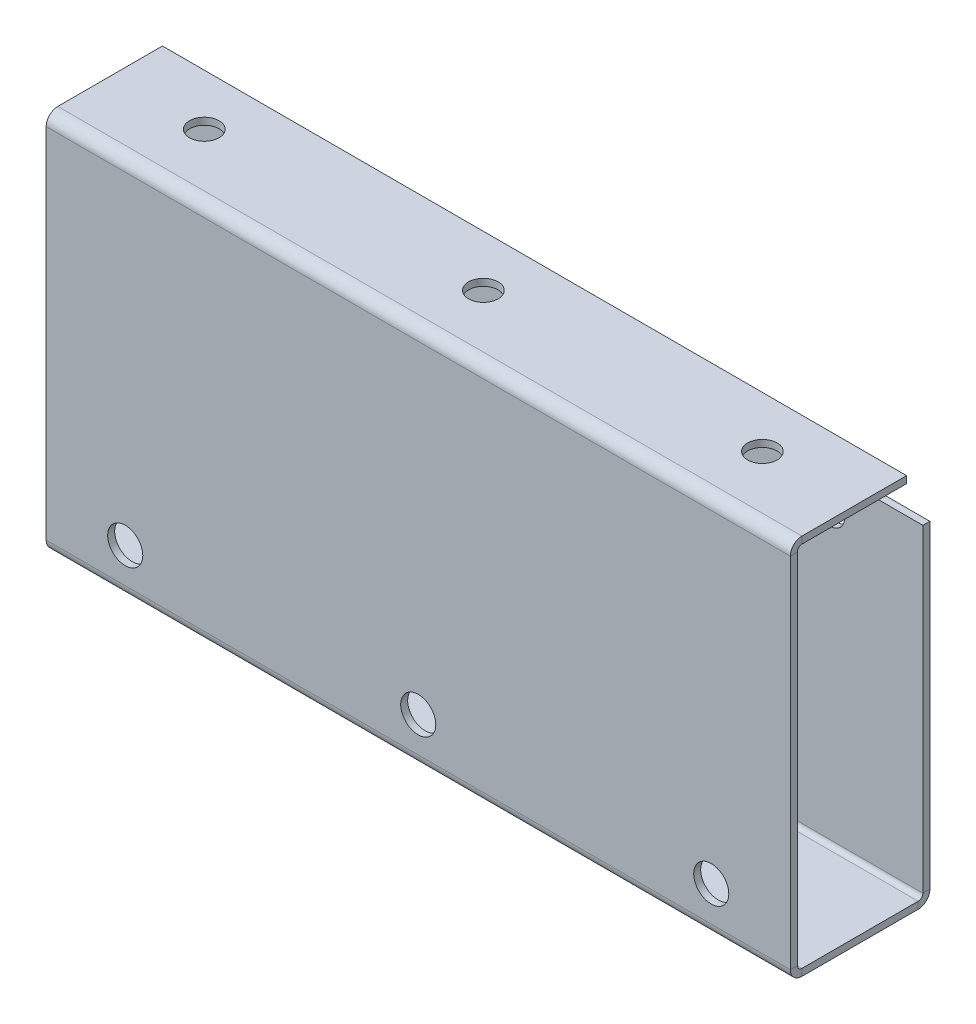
ISO-10303-21;
HEADER;
FILE_DESCRIPTION(('STEP AP214'),'2;1');
FILE_NAME('part.step','',(''),(''),'','','');
FILE_SCHEMA(('AUTOMOTIVE_DESIGN { 1 0 10303 214 1 1 1 1 }'));
ENDSEC;
DATA;
#1=APPLICATION_CONTEXT('core data for automotive mechanical design processes');
#2=APPLICATION_PROTOCOL_DEFINITION('international standard','automotive_design',2000,#1);
#3=PRODUCT_CONTEXT('',#1,'mechanical');
#4=PRODUCT('Part','Part','',(#3));
#5=PRODUCT_RELATED_PRODUCT_CATEGORY('part','',(#4));
#6=PRODUCT_DEFINITION_FORMATION('','',#4);
#7=PRODUCT_DEFINITION_CONTEXT('part definition',#1,'design');
#8=PRODUCT_DEFINITION('design','',#6,#7);
#9=PRODUCT_DEFINITION_SHAPE('','',#8);
#10=(LENGTH_UNIT() NAMED_UNIT(*) SI_UNIT(.MILLI.,.METRE.));
#11=(NAMED_UNIT(*) PLANE_ANGLE_UNIT() SI_UNIT($,.RADIAN.));
#12=(NAMED_UNIT(*) SI_UNIT($,.STERADIAN.) SOLID_ANGLE_UNIT());
#13=UNCERTAINTY_MEASURE_WITH_UNIT(LENGTH_MEASURE(1.E-05),#10,'distance_accuracy_value','');
#14=(GEOMETRIC_REPRESENTATION_CONTEXT(3) GLOBAL_UNCERTAINTY_ASSIGNED_CONTEXT((#13)) GLOBAL_UNIT_ASSIGNED_CONTEXT((#10,
#11,#12)) REPRESENTATION_CONTEXT('',''));
#15=CARTESIAN_POINT('',(0.,0.,0.));
#16=DIRECTION('',(0.,0.,1.));
#17=DIRECTION('',(1.,0.,0.));
#18=AXIS2_PLACEMENT_3D('',#15,#16,#17);
#19=CARTESIAN_POINT('',(80.,-82.,-27.5));
#20=DIRECTION('',(1.,0.,0.));
#21=DIRECTION('',(0.,0.,-1.));
#22=AXIS2_PLACEMENT_3D('',#19,#20,#21);
#23=PLANE('',#22);
#24=DIRECTION('',(0.,1.,0.));
#25=VECTOR('',#24,1.);
#26=CARTESIAN_POINT('',(80.,-82.,-27.5));
#27=LINE('',#26,#25);
#28=CARTESIAN_POINT('',(80.,-82.,-27.5));
#29=VERTEX_POINT('',#28);
#30=CARTESIAN_POINT('',(80.,-80.5,-27.5));
#31=VERTEX_POINT('',#30);
#32=EDGE_CURVE('E11',#29,#31,#27,.T.);
#33=ORIENTED_EDGE('',*,*,#32,.F.);
#34=CARTESIAN_POINT('',(80.,-79.5,-27.5));
#35=DIRECTION('',(1.,0.,0.));
#36=DIRECTION('',(0.,0.,-1.));
#37=AXIS2_PLACEMENT_3D('',#34,#35,#36);
#38=CIRCLE('',#37,2.5);
#39=CARTESIAN_POINT('',(80.,-79.5,-30.));
#40=VERTEX_POINT('',#39);
#41=EDGE_CURVE('E312',#40,#29,#38,.F.);
#42=ORIENTED_EDGE('',*,*,#41,.F.);
#43=DIRECTION('',(0.,0.,-1.));
#44=VECTOR('',#43,1.);
#45=CARTESIAN_POINT('',(80.,-79.5,-28.5));
#46=LINE('',#45,#44);
#47=CARTESIAN_POINT('',(80.,-79.5,-28.5));
#48=VERTEX_POINT('',#47);
#49=EDGE_CURVE('E45',#48,#40,#46,.T.);
#50=ORIENTED_EDGE('',*,*,#49,.F.);
#51=CARTESIAN_POINT('',(80.,-79.5,-27.5));
#52=DIRECTION('',(1.,0.,0.));
#53=DIRECTION('',(0.,0.,-1.));
#54=AXIS2_PLACEMENT_3D('',#51,#52,#53);
#55=CIRCLE('',#54,1.);
#56=EDGE_CURVE('E325',#48,#31,#55,.F.);
#57=ORIENTED_EDGE('',*,*,#56,.T.);
#58=EDGE_LOOP('',(#33,#42,#50,#57));
#59=FACE_BOUND('',#58,.T.);
#60=ADVANCED_FACE('F36',(#59),#23,.T.);
#61=CARTESIAN_POINT('',(80.,-79.5,-28.5));
#62=DIRECTION('',(1.,0.,0.));
#63=DIRECTION('',(0.,0.,-1.));
#64=AXIS2_PLACEMENT_3D('',#61,#62,#63);
#65=PLANE('',#64);
#66=DIRECTION('',(0.,0.,1.));
#67=VECTOR('',#66,1.);
#68=CARTESIAN_POINT('',(80.,-82.,0.));
#69=LINE('',#68,#67);
#70=CARTESIAN_POINT('',(80.,-82.,-2.50000000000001));
#71=VERTEX_POINT('',#70);
#72=EDGE_CURVE('E316',#29,#71,#69,.T.);
#73=ORIENTED_EDGE('',*,*,#72,.F.);
#74=ORIENTED_EDGE('',*,*,#32,.T.);
#75=DIRECTION('',(0.,0.,-1.));
#76=VECTOR('',#75,1.);
#77=CARTESIAN_POINT('',(80.,-80.5,0.));
#78=LINE('',#77,#76);
#79=CARTESIAN_POINT('',(80.,-80.5,-2.50000000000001));
#80=VERTEX_POINT('',#79);
#81=EDGE_CURVE('E180',#31,#80,#78,.F.);
#82=ORIENTED_EDGE('',*,*,#81,.T.);
#83=DIRECTION('',(0.,-1.,0.));
#84=VECTOR('',#83,1.);
#85=CARTESIAN_POINT('',(80.,-80.5,-2.50000000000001));
#86=LINE('',#85,#84);
#87=EDGE_CURVE('E171',#80,#71,#86,.T.);
#88=ORIENTED_EDGE('',*,*,#87,.T.);
#89=EDGE_LOOP('',(#73,#74,#82,#88));
#90=FACE_BOUND('',#89,.T.);
#91=ADVANCED_FACE('F330',(#90),#65,.T.);
#92=CARTESIAN_POINT('',(-80.,-79.5,-30.));
#93=DIRECTION('',(-1.,0.,0.));
#94=DIRECTION('',(0.,0.,1.));
#95=AXIS2_PLACEMENT_3D('',#92,#93,#94);
#96=PLANE('',#95);
#97=DIRECTION('',(0.,0.,1.));
#98=VECTOR('',#97,1.);
#99=CARTESIAN_POINT('',(-80.,-79.5,-30.));
#100=LINE('',#99,#98);
#101=CARTESIAN_POINT('',(-80.,-79.5,-30.));
#102=VERTEX_POINT('',#101);
#103=CARTESIAN_POINT('',(-80.,-79.5,-28.5));
#104=VERTEX_POINT('',#103);
#105=EDGE_CURVE('E291',#102,#104,#100,.T.);
#106=ORIENTED_EDGE('',*,*,#105,.F.);
#107=CARTESIAN_POINT('',(-80.,-79.5,-27.5));
#108=DIRECTION('',(1.,0.,0.));
#109=DIRECTION('',(0.,0.,-1.));
#110=AXIS2_PLACEMENT_3D('',#107,#108,#109);
#111=CIRCLE('',#110,2.5);
#112=CARTESIAN_POINT('',(-80.,-82.,-27.5));
#113=VERTEX_POINT('',#112);
#114=EDGE_CURVE('E221',#102,#113,#111,.F.);
#115=ORIENTED_EDGE('',*,*,#114,.T.);
#116=DIRECTION('',(0.,-1.,0.));
#117=VECTOR('',#116,1.);
#118=CARTESIAN_POINT('',(-80.,-80.5,-27.5));
#119=LINE('',#118,#117);
#120=CARTESIAN_POINT('',(-80.,-80.5,-27.5));
#121=VERTEX_POINT('',#120);
#122=EDGE_CURVE('E170',#121,#113,#119,.T.);
#123=ORIENTED_EDGE('',*,*,#122,.F.);
#124=CARTESIAN_POINT('',(-80.,-79.5,-27.5));
#125=DIRECTION('',(1.,0.,0.));
#126=DIRECTION('',(0.,0.,-1.));
#127=AXIS2_PLACEMENT_3D('',#124,#125,#126);
#128=CIRCLE('',#127,1.);
#129=EDGE_CURVE('E233',#104,#121,#128,.F.);
#130=ORIENTED_EDGE('',*,*,#129,.F.);
#131=EDGE_LOOP('',(#106,#115,#123,#130));
#132=FACE_BOUND('',#131,.T.);
#133=ADVANCED_FACE('F383',(#132),#96,.T.);
#134=CARTESIAN_POINT('',(-80.,-80.5,-27.5));
#135=DIRECTION('',(-1.,0.,0.));
#136=DIRECTION('',(0.,0.,1.));
#137=AXIS2_PLACEMENT_3D('',#134,#135,#136);
#138=PLANE('',#137);
#139=DIRECTION('',(0.,-1.,0.));
#140=VECTOR('',#139,1.);
#141=CARTESIAN_POINT('',(-80.,-82.,-30.));
#142=LINE('',#141,#140);
#143=CARTESIAN_POINT('',(-80.,-11.,-30.));
#144=VERTEX_POINT('',#143);
#145=EDGE_CURVE('E224',#144,#102,#142,.T.);
#146=ORIENTED_EDGE('',*,*,#145,.T.);
#147=ORIENTED_EDGE('',*,*,#105,.T.);
#148=DIRECTION('',(0.,-1.,0.));
#149=VECTOR('',#148,1.);
#150=CARTESIAN_POINT('',(-80.,-82.,-28.5));
#151=LINE('',#150,#149);
#152=CARTESIAN_POINT('',(-80.,-11.,-28.5));
#153=VERTEX_POINT('',#152);
#154=EDGE_CURVE('E230',#153,#104,#151,.T.);
#155=ORIENTED_EDGE('',*,*,#154,.F.);
#156=DIRECTION('',(0.,0.,-1.));
#157=VECTOR('',#156,1.);
#158=CARTESIAN_POINT('',(-80.,-11.,-28.5));
#159=LINE('',#158,#157);
#160=EDGE_CURVE('E227',#153,#144,#159,.T.);
#161=ORIENTED_EDGE('',*,*,#160,.T.);
#162=EDGE_LOOP('',(#146,#147,#155,#161));
#163=FACE_BOUND('',#162,.T.);
#164=ADVANCED_FACE('F387',(#163),#138,.T.);
#165=CARTESIAN_POINT('',(80.,-79.5,0.));
#166=DIRECTION('',(1.,0.,0.));
#167=DIRECTION('',(0.,0.,-1.));
#168=AXIS2_PLACEMENT_3D('',#165,#166,#167);
#169=PLANE('',#168);
#170=DIRECTION('',(0.,0.,-1.));
#171=VECTOR('',#170,1.);
#172=CARTESIAN_POINT('',(80.,-79.5,0.));
#173=LINE('',#172,#171);
#174=CARTESIAN_POINT('',(80.,-79.5,0.));
#175=VERTEX_POINT('',#174);
#176=CARTESIAN_POINT('',(80.,-79.5,-1.50000000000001));
#177=VERTEX_POINT('',#176);
#178=EDGE_CURVE('E158',#175,#177,#173,.T.);
#179=ORIENTED_EDGE('',*,*,#178,.F.);
#180=CARTESIAN_POINT('',(80.,-79.5,-2.50000000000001));
#181=DIRECTION('',(1.,0.,0.));
#182=DIRECTION('',(0.,0.,-1.));
#183=AXIS2_PLACEMENT_3D('',#180,#181,#182);
#184=CIRCLE('',#183,2.5);
#185=EDGE_CURVE('E342',#71,#175,#184,.F.);
#186=ORIENTED_EDGE('',*,*,#185,.F.);
#187=ORIENTED_EDGE('',*,*,#87,.F.);
#188=CARTESIAN_POINT('',(80.,-79.5,-2.50000000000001));
#189=DIRECTION('',(1.,0.,0.));
#190=DIRECTION('',(0.,0.,-1.));
#191=AXIS2_PLACEMENT_3D('',#188,#189,#190);
#192=CIRCLE('',#191,1.);
#193=EDGE_CURVE('E174',#80,#177,#192,.F.);
#194=ORIENTED_EDGE('',*,*,#193,.T.);
#195=EDGE_LOOP('',(#179,#186,#187,#194));
#196=FACE_BOUND('',#195,.T.);
#197=ADVANCED_FACE('F176',(#196),#169,.T.);
#198=CARTESIAN_POINT('',(80.,-80.5,-2.50000000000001));
#199=DIRECTION('',(1.,0.,0.));
#200=DIRECTION('',(0.,0.,-1.));
#201=AXIS2_PLACEMENT_3D('',#198,#199,#200);
#202=PLANE('',#201);
#203=DIRECTION('',(0.,1.,0.));
#204=VECTOR('',#203,1.);
#205=CARTESIAN_POINT('',(80.,0.,0.));
#206=LINE('',#205,#204);
#207=CARTESIAN_POINT('',(80.,-2.5,0.));
#208=VERTEX_POINT('',#207);
#209=EDGE_CURVE('E165',#175,#208,#206,.T.);
#210=ORIENTED_EDGE('',*,*,#209,.F.);
#211=ORIENTED_EDGE('',*,*,#178,.T.);
#212=DIRECTION('',(0.,1.,0.));
#213=VECTOR('',#212,1.);
#214=CARTESIAN_POINT('',(80.,0.,-1.5));
#215=LINE('',#214,#213);
#216=CARTESIAN_POINT('',(80.,-2.5,-1.5));
#217=VERTEX_POINT('',#216);
#218=EDGE_CURVE('E162',#177,#217,#215,.T.);
#219=ORIENTED_EDGE('',*,*,#218,.T.);
#220=DIRECTION('',(0.,0.,1.));
#221=VECTOR('',#220,1.);
#222=CARTESIAN_POINT('',(80.,-2.5,-1.5));
#223=LINE('',#222,#221);
#224=EDGE_CURVE('E282',#217,#208,#223,.T.);
#225=ORIENTED_EDGE('',*,*,#224,.T.);
#226=EDGE_LOOP('',(#210,#211,#219,#225));
#227=FACE_BOUND('',#226,.T.);
#228=ADVANCED_FACE('F160',(#227),#202,.T.);
#229=CARTESIAN_POINT('',(-80.,-82.,-2.50000000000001));
#230=DIRECTION('',(-1.,0.,0.));
#231=DIRECTION('',(0.,0.,1.));
#232=AXIS2_PLACEMENT_3D('',#229,#230,#231);
#233=PLANE('',#232);
#234=DIRECTION('',(0.,1.,0.));
#235=VECTOR('',#234,1.);
#236=CARTESIAN_POINT('',(-80.,-82.,-2.50000000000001));
#237=LINE('',#236,#235);
#238=CARTESIAN_POINT('',(-80.,-82.,-2.50000000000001));
#239=VERTEX_POINT('',#238);
#240=CARTESIAN_POINT('',(-80.,-80.5,-2.50000000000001));
#241=VERTEX_POINT('',#240);
#242=EDGE_CURVE('E287',#239,#241,#237,.T.);
#243=ORIENTED_EDGE('',*,*,#242,.F.);
#244=CARTESIAN_POINT('',(-80.,-79.5,-2.50000000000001));
#245=DIRECTION('',(1.,0.,0.));
#246=DIRECTION('',(0.,0.,-1.));
#247=AXIS2_PLACEMENT_3D('',#244,#245,#246);
#248=CIRCLE('',#247,2.5);
#249=CARTESIAN_POINT('',(-80.,-79.5,0.));
#250=VERTEX_POINT('',#249);
#251=EDGE_CURVE('E215',#239,#250,#248,.F.);
#252=ORIENTED_EDGE('',*,*,#251,.T.);
#253=DIRECTION('',(0.,0.,1.));
#254=VECTOR('',#253,1.);
#255=CARTESIAN_POINT('',(-80.,-79.5,-1.50000000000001));
#256=LINE('',#255,#254);
#257=CARTESIAN_POINT('',(-80.,-79.5,-1.50000000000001));
#258=VERTEX_POINT('',#257);
#259=EDGE_CURVE('E285',#258,#250,#256,.T.);
#260=ORIENTED_EDGE('',*,*,#259,.F.);
#261=CARTESIAN_POINT('',(-80.,-79.5,-2.50000000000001));
#262=DIRECTION('',(1.,0.,0.));
#263=DIRECTION('',(0.,0.,-1.));
#264=AXIS2_PLACEMENT_3D('',#261,#262,#263);
#265=CIRCLE('',#264,1.);
#266=EDGE_CURVE('E187',#241,#258,#265,.F.);
#267=ORIENTED_EDGE('',*,*,#266,.F.);
#268=EDGE_LOOP('',(#243,#252,#260,#267));
#269=FACE_BOUND('',#268,.T.);
#270=ADVANCED_FACE('F336',(#269),#233,.T.);
#271=CARTESIAN_POINT('',(-80.,-79.5,-1.50000000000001));
#272=DIRECTION('',(-1.,0.,0.));
#273=DIRECTION('',(0.,0.,1.));
#274=AXIS2_PLACEMENT_3D('',#271,#272,#273);
#275=PLANE('',#274);
#276=DIRECTION('',(0.,0.,1.));
#277=VECTOR('',#276,1.);
#278=CARTESIAN_POINT('',(-80.,-82.,0.));
#279=LINE('',#278,#277);
#280=EDGE_CURVE('E218',#113,#239,#279,.T.);
#281=ORIENTED_EDGE('',*,*,#280,.T.);
#282=ORIENTED_EDGE('',*,*,#242,.T.);
#283=DIRECTION('',(0.,0.,-1.));
#284=VECTOR('',#283,1.);
#285=CARTESIAN_POINT('',(-80.,-80.5,0.));
#286=LINE('',#285,#284);
#287=EDGE_CURVE('E236',#121,#241,#286,.F.);
#288=ORIENTED_EDGE('',*,*,#287,.F.);
#289=ORIENTED_EDGE('',*,*,#122,.T.);
#290=EDGE_LOOP('',(#281,#282,#288,#289));
#291=FACE_BOUND('',#290,.T.);
#292=ADVANCED_FACE('F395',(#291),#275,.T.);
#293=CARTESIAN_POINT('',(80.,0.,-2.5));
#294=DIRECTION('',(1.,0.,0.));
#295=DIRECTION('',(0.,0.,-1.));
#296=AXIS2_PLACEMENT_3D('',#293,#294,#295);
#297=PLANE('',#296);
#298=DIRECTION('',(0.,-1.,0.));
#299=VECTOR('',#298,1.);
#300=CARTESIAN_POINT('',(80.,0.,-2.5));
#301=LINE('',#300,#299);
#302=CARTESIAN_POINT('',(80.,0.,-2.5));
#303=VERTEX_POINT('',#302);
#304=CARTESIAN_POINT('',(80.,-1.5,-2.5));
#305=VERTEX_POINT('',#304);
#306=EDGE_CURVE('E53',#303,#305,#301,.T.);
#307=ORIENTED_EDGE('',*,*,#306,.F.);
#308=CARTESIAN_POINT('',(80.,-2.5,-2.5));
#309=DIRECTION('',(1.,0.,0.));
#310=DIRECTION('',(0.,0.,-1.));
#311=AXIS2_PLACEMENT_3D('',#308,#309,#310);
#312=CIRCLE('',#311,2.5);
#313=EDGE_CURVE('E370',#208,#303,#312,.F.);
#314=ORIENTED_EDGE('',*,*,#313,.F.);
#315=ORIENTED_EDGE('',*,*,#224,.F.);
#316=CARTESIAN_POINT('',(80.,-2.5,-2.5));
#317=DIRECTION('',(1.,0.,0.));
#318=DIRECTION('',(0.,0.,-1.));
#319=AXIS2_PLACEMENT_3D('',#316,#317,#318);
#320=CIRCLE('',#319,1.);
#321=EDGE_CURVE('E195',#217,#305,#320,.F.);
#322=ORIENTED_EDGE('',*,*,#321,.T.);
#323=EDGE_LOOP('',(#307,#314,#315,#322));
#324=FACE_BOUND('',#323,.T.);
#325=ADVANCED_FACE('F397',(#324),#297,.T.);
#326=CARTESIAN_POINT('',(80.,-2.5,-1.5));
#327=DIRECTION('',(1.,0.,0.));
#328=DIRECTION('',(0.,0.,-1.));
#329=AXIS2_PLACEMENT_3D('',#326,#327,#328);
#330=PLANE('',#329);
#331=DIRECTION('',(0.,0.,-1.));
#332=VECTOR('',#331,1.);
#333=CARTESIAN_POINT('',(80.,0.,0.));
#334=LINE('',#333,#332);
#335=CARTESIAN_POINT('',(80.,0.,-25.));
#336=VERTEX_POINT('',#335);
#337=EDGE_CURVE('E368',#303,#336,#334,.T.);
#338=ORIENTED_EDGE('',*,*,#337,.F.);
#339=ORIENTED_EDGE('',*,*,#306,.T.);
#340=DIRECTION('',(0.,0.,-1.));
#341=VECTOR('',#340,1.);
#342=CARTESIAN_POINT('',(80.,-1.5,0.));
#343=LINE('',#342,#341);
#344=CARTESIAN_POINT('',(80.,-1.5,-25.));
#345=VERTEX_POINT('',#344);
#346=EDGE_CURVE('E119',#305,#345,#343,.T.);
#347=ORIENTED_EDGE('',*,*,#346,.T.);
#348=DIRECTION('',(0.,-1.,0.));
#349=VECTOR('',#348,1.);
#350=CARTESIAN_POINT('',(80.,0.,-25.));
#351=LINE('',#350,#349);
#352=EDGE_CURVE('E366',#336,#345,#351,.T.);
#353=ORIENTED_EDGE('',*,*,#352,.F.);
#354=EDGE_LOOP('',(#338,#339,#347,#353));
#355=FACE_BOUND('',#354,.T.);
#356=ADVANCED_FACE('F403',(#355),#330,.T.);
#357=CARTESIAN_POINT('',(-80.,-2.5,0.));
#358=DIRECTION('',(-1.,0.,0.));
#359=DIRECTION('',(0.,0.,1.));
#360=AXIS2_PLACEMENT_3D('',#357,#358,#359);
#361=PLANE('',#360);
#362=DIRECTION('',(0.,0.,-1.));
#363=VECTOR('',#362,1.);
#364=CARTESIAN_POINT('',(-80.,-2.5,0.));
#365=LINE('',#364,#363);
#366=CARTESIAN_POINT('',(-80.,-2.5,0.));
#367=VERTEX_POINT('',#366);
#368=CARTESIAN_POINT('',(-80.,-2.5,-1.5));
#369=VERTEX_POINT('',#368);
#370=EDGE_CURVE('E106',#367,#369,#365,.T.);
#371=ORIENTED_EDGE('',*,*,#370,.F.);
#372=CARTESIAN_POINT('',(-80.,-2.5,-2.5));
#373=DIRECTION('',(1.,0.,0.));
#374=DIRECTION('',(0.,0.,-1.));
#375=AXIS2_PLACEMENT_3D('',#372,#373,#374);
#376=CIRCLE('',#375,2.5);
#377=CARTESIAN_POINT('',(-80.,0.,-2.5));
#378=VERTEX_POINT('',#377);
#379=EDGE_CURVE('E211',#367,#378,#376,.F.);
#380=ORIENTED_EDGE('',*,*,#379,.T.);
#381=DIRECTION('',(0.,1.,0.));
#382=VECTOR('',#381,1.);
#383=CARTESIAN_POINT('',(-80.,-1.5,-2.5));
#384=LINE('',#383,#382);
#385=CARTESIAN_POINT('',(-80.,-1.5,-2.5));
#386=VERTEX_POINT('',#385);
#387=EDGE_CURVE('E113',#386,#378,#384,.T.);
#388=ORIENTED_EDGE('',*,*,#387,.F.);
#389=CARTESIAN_POINT('',(-80.,-2.5,-2.5));
#390=DIRECTION('',(1.,0.,0.));
#391=DIRECTION('',(0.,0.,-1.));
#392=AXIS2_PLACEMENT_3D('',#389,#390,#391);
#393=CIRCLE('',#392,1.);
#394=EDGE_CURVE('E242',#369,#386,#393,.F.);
#395=ORIENTED_EDGE('',*,*,#394,.F.);
#396=EDGE_LOOP('',(#371,#380,#388,#395));
#397=FACE_BOUND('',#396,.T.);
#398=ADVANCED_FACE('F353',(#397),#361,.T.);
#399=CARTESIAN_POINT('',(-80.,-1.5,-2.5));
#400=DIRECTION('',(-1.,0.,0.));
#401=DIRECTION('',(0.,0.,1.));
#402=AXIS2_PLACEMENT_3D('',#399,#400,#401);
#403=PLANE('',#402);
#404=DIRECTION('',(0.,1.,0.));
#405=VECTOR('',#404,1.);
#406=CARTESIAN_POINT('',(-80.,0.,0.));
#407=LINE('',#406,#405);
#408=EDGE_CURVE('E213',#250,#367,#407,.T.);
#409=ORIENTED_EDGE('',*,*,#408,.T.);
#410=ORIENTED_EDGE('',*,*,#370,.T.);
#411=DIRECTION('',(0.,1.,0.));
#412=VECTOR('',#411,1.);
#413=CARTESIAN_POINT('',(-80.,0.,-1.5));
#414=LINE('',#413,#412);
#415=EDGE_CURVE('E240',#258,#369,#414,.T.);
#416=ORIENTED_EDGE('',*,*,#415,.F.);
#417=ORIENTED_EDGE('',*,*,#259,.T.);
#418=EDGE_LOOP('',(#409,#410,#416,#417));
#419=FACE_BOUND('',#418,.T.);
#420=ADVANCED_FACE('F338',(#419),#403,.T.);
#421=CARTESIAN_POINT('',(80.,-1.5,0.));
#422=DIRECTION('',(0.,1.,0.));
#423=DIRECTION('',(0.,0.,1.));
#424=AXIS2_PLACEMENT_3D('',#421,#422,#423);
#425=PLANE('',#424);
#426=CARTESIAN_POINT('',(60.,-1.5,-14.));
#427=DIRECTION('',(0.,-1.,0.));
#428=DIRECTION('',(0.,0.,-1.));
#429=AXIS2_PLACEMENT_3D('',#426,#427,#428);
#430=CIRCLE('',#429,3.175);
#431=CARTESIAN_POINT('',(60.,-1.5,-17.175));
#432=VERTEX_POINT('',#431);
#433=EDGE_CURVE('E791',#432,#432,#430,.T.);
#434=ORIENTED_EDGE('',*,*,#433,.F.);
#435=EDGE_LOOP('',(#434));
#436=FACE_BOUND('',#435,.T.);
#437=CARTESIAN_POINT('',(-60.,-1.5,-14.));
#438=DIRECTION('',(0.,-1.,0.));
#439=DIRECTION('',(0.,0.,-1.));
#440=AXIS2_PLACEMENT_3D('',#437,#438,#439);
#441=CIRCLE('',#440,3.175);
#442=CARTESIAN_POINT('',(-60.,-1.5,-17.175));
#443=VERTEX_POINT('',#442);
#444=EDGE_CURVE('E794',#443,#443,#441,.T.);
#445=ORIENTED_EDGE('',*,*,#444,.F.);
#446=EDGE_LOOP('',(#445));
#447=FACE_BOUND('',#446,.T.);
#448=CARTESIAN_POINT('',(0.,-1.5,-14.));
#449=DIRECTION('',(0.,-1.,0.));
#450=DIRECTION('',(0.,0.,-1.));
#451=AXIS2_PLACEMENT_3D('',#448,#449,#450);
#452=CIRCLE('',#451,3.175);
#453=CARTESIAN_POINT('',(0.,-1.5,-17.175));
#454=VERTEX_POINT('',#453);
#455=EDGE_CURVE('E800',#454,#454,#452,.T.);
#456=ORIENTED_EDGE('',*,*,#455,.F.);
#457=EDGE_LOOP('',(#456));
#458=FACE_BOUND('',#457,.T.);
#459=DIRECTION('',(0.,0.,-1.));
#460=VECTOR('',#459,1.);
#461=CARTESIAN_POINT('',(-80.,-1.5,0.));
#462=LINE('',#461,#460);
#463=CARTESIAN_POINT('',(-80.,-1.5,-25.));
#464=VERTEX_POINT('',#463);
#465=EDGE_CURVE('E201',#386,#464,#462,.T.);
#466=ORIENTED_EDGE('',*,*,#465,.T.);
#467=DIRECTION('',(-1.,0.,0.));
#468=VECTOR('',#467,1.);
#469=CARTESIAN_POINT('',(80.,-1.5,-25.));
#470=LINE('',#469,#468);
#471=EDGE_CURVE('E278',#345,#464,#470,.T.);
#472=ORIENTED_EDGE('',*,*,#471,.F.);
#473=ORIENTED_EDGE('',*,*,#346,.F.);
#474=DIRECTION('',(-1.,0.,0.));
#475=VECTOR('',#474,1.);
#476=CARTESIAN_POINT('',(80.,-1.5,-2.5));
#477=LINE('',#476,#475);
#478=EDGE_CURVE('E197',#305,#386,#477,.T.);
#479=ORIENTED_EDGE('',*,*,#478,.T.);
#480=EDGE_LOOP('',(#466,#472,#473,#479));
#481=FACE_BOUND('',#480,.T.);
#482=ADVANCED_FACE('F359',(#436,#447,#458,#481),#425,.F.);
#483=CARTESIAN_POINT('',(80.,0.,-25.));
#484=DIRECTION('',(0.,0.,-1.));
#485=DIRECTION('',(-1.,0.,0.));
#486=AXIS2_PLACEMENT_3D('',#483,#484,#485);
#487=PLANE('',#486);
#488=DIRECTION('',(0.,-1.,0.));
#489=VECTOR('',#488,1.);
#490=CARTESIAN_POINT('',(-80.,0.,-25.));
#491=LINE('',#490,#489);
#492=CARTESIAN_POINT('',(-80.,0.,-25.));
#493=VERTEX_POINT('',#492);
#494=EDGE_CURVE('E204',#493,#464,#491,.T.);
#495=ORIENTED_EDGE('',*,*,#494,.F.);
#496=DIRECTION('',(-1.,0.,0.));
#497=VECTOR('',#496,1.);
#498=CARTESIAN_POINT('',(80.,0.,-25.));
#499=LINE('',#498,#497);
#500=EDGE_CURVE('E276',#336,#493,#499,.T.);
#501=ORIENTED_EDGE('',*,*,#500,.F.);
#502=ORIENTED_EDGE('',*,*,#352,.T.);
#503=ORIENTED_EDGE('',*,*,#471,.T.);
#504=EDGE_LOOP('',(#495,#501,#502,#503));
#505=FACE_BOUND('',#504,.T.);
#506=ADVANCED_FACE('F364',(#505),#487,.T.);
#507=CARTESIAN_POINT('',(80.,0.,0.));
#508=DIRECTION('',(0.,1.,0.));
#509=DIRECTION('',(0.,0.,1.));
#510=AXIS2_PLACEMENT_3D('',#507,#508,#509);
#511=PLANE('',#510);
#512=CARTESIAN_POINT('',(60.,0.,-14.));
#513=DIRECTION('',(0.,1.,0.));
#514=DIRECTION('',(0.,0.,1.));
#515=AXIS2_PLACEMENT_3D('',#512,#513,#514);
#516=CIRCLE('',#515,3.175);
#517=CARTESIAN_POINT('',(60.,0.,-10.825));
#518=VERTEX_POINT('',#517);
#519=EDGE_CURVE('E39',#518,#518,#516,.T.);
#520=ORIENTED_EDGE('',*,*,#519,.F.);
#521=EDGE_LOOP('',(#520));
#522=FACE_BOUND('',#521,.T.);
#523=CARTESIAN_POINT('',(-60.,0.,-14.));
#524=DIRECTION('',(0.,1.,0.));
#525=DIRECTION('',(0.,0.,1.));
#526=AXIS2_PLACEMENT_3D('',#523,#524,#525);
#527=CIRCLE('',#526,3.175);
#528=CARTESIAN_POINT('',(-60.,0.,-10.825));
#529=VERTEX_POINT('',#528);
#530=EDGE_CURVE('E797',#529,#529,#527,.T.);
#531=ORIENTED_EDGE('',*,*,#530,.F.);
#532=EDGE_LOOP('',(#531));
#533=FACE_BOUND('',#532,.T.);
#534=CARTESIAN_POINT('',(0.,0.,-14.));
#535=DIRECTION('',(0.,1.,0.));
#536=DIRECTION('',(0.,0.,1.));
#537=AXIS2_PLACEMENT_3D('',#534,#535,#536);
#538=CIRCLE('',#537,3.175);
#539=CARTESIAN_POINT('',(0.,0.,-10.825));
#540=VERTEX_POINT('',#539);
#541=EDGE_CURVE('E205',#540,#540,#538,.T.);
#542=ORIENTED_EDGE('',*,*,#541,.F.);
#543=EDGE_LOOP('',(#542));
#544=FACE_BOUND('',#543,.T.);
#545=DIRECTION('',(0.,0.,-1.));
#546=VECTOR('',#545,1.);
#547=CARTESIAN_POINT('',(-80.,0.,0.));
#548=LINE('',#547,#546);
#549=EDGE_CURVE('E208',#378,#493,#548,.T.);
#550=ORIENTED_EDGE('',*,*,#549,.F.);
#551=DIRECTION('',(-1.,0.,0.));
#552=VECTOR('',#551,1.);
#553=CARTESIAN_POINT('',(80.,0.,-2.5));
#554=LINE('',#553,#552);
#555=EDGE_CURVE('E273',#303,#378,#554,.T.);
#556=ORIENTED_EDGE('',*,*,#555,.F.);
#557=ORIENTED_EDGE('',*,*,#337,.T.);
#558=ORIENTED_EDGE('',*,*,#500,.T.);
#559=EDGE_LOOP('',(#550,#556,#557,#558));
#560=FACE_BOUND('',#559,.T.);
#561=ADVANCED_FACE('F480',(#522,#533,#544,#560),#511,.T.);
#562=CARTESIAN_POINT('',(80.,-2.5,-2.5));
#563=DIRECTION('',(-1.,0.,0.));
#564=DIRECTION('',(0.,0.,1.));
#565=AXIS2_PLACEMENT_3D('',#562,#563,#564);
#566=CYLINDRICAL_SURFACE('',#565,2.5);
#567=ORIENTED_EDGE('',*,*,#379,.F.);
#568=DIRECTION('',(-1.,0.,0.));
#569=VECTOR('',#568,1.);
#570=CARTESIAN_POINT('',(80.,-2.5,0.));
#571=LINE('',#570,#569);
#572=EDGE_CURVE('E270',#208,#367,#571,.T.);
#573=ORIENTED_EDGE('',*,*,#572,.F.);
#574=ORIENTED_EDGE('',*,*,#313,.T.);
#575=ORIENTED_EDGE('',*,*,#555,.T.);
#576=EDGE_LOOP('',(#567,#573,#574,#575));
#577=FACE_BOUND('',#576,.T.);
#578=ADVANCED_FACE('F350',(#577),#566,.T.);
#579=CARTESIAN_POINT('',(80.,0.,0.));
#580=DIRECTION('',(0.,0.,1.));
#581=DIRECTION('',(0.,-1.,0.));
#582=AXIS2_PLACEMENT_3D('',#579,#580,#581);
#583=PLANE('',#582);
#584=CARTESIAN_POINT('',(-62.9999999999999,-72.,0.));
#585=DIRECTION('',(0.,0.,1.));
#586=DIRECTION('',(1.,0.,0.));
#587=AXIS2_PLACEMENT_3D('',#584,#585,#586);
#588=CIRCLE('',#587,3.770376);
#589=CARTESIAN_POINT('',(-59.2296239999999,-72.,0.));
#590=VERTEX_POINT('',#589);
#591=EDGE_CURVE('E754',#590,#590,#588,.T.);
#592=ORIENTED_EDGE('',*,*,#591,.F.);
#593=EDGE_LOOP('',(#592));
#594=FACE_BOUND('',#593,.T.);
#595=CARTESIAN_POINT('',(1.2490009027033E-13,-72.,0.));
#596=DIRECTION('',(0.,0.,1.));
#597=DIRECTION('',(1.,0.,0.));
#598=AXIS2_PLACEMENT_3D('',#595,#596,#597);
#599=CIRCLE('',#598,3.770376);
#600=CARTESIAN_POINT('',(3.77037600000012,-72.,0.));
#601=VERTEX_POINT('',#600);
#602=EDGE_CURVE('E758',#601,#601,#599,.T.);
#603=ORIENTED_EDGE('',*,*,#602,.F.);
#604=EDGE_LOOP('',(#603));
#605=FACE_BOUND('',#604,.T.);
#606=CARTESIAN_POINT('',(63.0000000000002,-71.9999999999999,0.));
#607=DIRECTION('',(0.,0.,1.));
#608=DIRECTION('',(1.,0.,0.));
#609=AXIS2_PLACEMENT_3D('',#606,#607,#608);
#610=CIRCLE('',#609,3.77037600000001);
#611=CARTESIAN_POINT('',(66.7703760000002,-71.9999999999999,0.));
#612=VERTEX_POINT('',#611);
#613=EDGE_CURVE('E767',#612,#612,#610,.T.);
#614=ORIENTED_EDGE('',*,*,#613,.F.);
#615=EDGE_LOOP('',(#614));
#616=FACE_BOUND('',#615,.T.);
#617=ORIENTED_EDGE('',*,*,#408,.F.);
#618=DIRECTION('',(-1.,0.,0.));
#619=VECTOR('',#618,1.);
#620=CARTESIAN_POINT('',(80.,-79.5,0.));
#621=LINE('',#620,#619);
#622=EDGE_CURVE('E267',#175,#250,#621,.T.);
#623=ORIENTED_EDGE('',*,*,#622,.F.);
#624=ORIENTED_EDGE('',*,*,#209,.T.);
#625=ORIENTED_EDGE('',*,*,#572,.T.);
#626=EDGE_LOOP('',(#617,#623,#624,#625));
#627=FACE_BOUND('',#626,.T.);
#628=ADVANCED_FACE('F344',(#594,#605,#616,#627),#583,.T.);
#629=CARTESIAN_POINT('',(80.,-79.5,-2.50000000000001));
#630=DIRECTION('',(-1.,0.,0.));
#631=DIRECTION('',(0.,0.,1.));
#632=AXIS2_PLACEMENT_3D('',#629,#630,#631);
#633=CYLINDRICAL_SURFACE('',#632,2.5);
#634=ORIENTED_EDGE('',*,*,#251,.F.);
#635=DIRECTION('',(-1.,0.,0.));
#636=VECTOR('',#635,1.);
#637=CARTESIAN_POINT('',(80.,-82.,-2.50000000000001));
#638=LINE('',#637,#636);
#639=EDGE_CURVE('E264',#71,#239,#638,.T.);
#640=ORIENTED_EDGE('',*,*,#639,.F.);
#641=ORIENTED_EDGE('',*,*,#185,.T.);
#642=ORIENTED_EDGE('',*,*,#622,.T.);
#643=EDGE_LOOP('',(#634,#640,#641,#642));
#644=FACE_BOUND('',#643,.T.);
#645=ADVANCED_FACE('F341',(#644),#633,.T.);
#646=CARTESIAN_POINT('',(80.,-82.,0.));
#647=DIRECTION('',(0.,-1.,0.));
#648=DIRECTION('',(0.,0.,-1.));
#649=AXIS2_PLACEMENT_3D('',#646,#647,#648);
#650=PLANE('',#649);
#651=ORIENTED_EDGE('',*,*,#280,.F.);
#652=DIRECTION('',(-1.,0.,0.));
#653=VECTOR('',#652,1.);
#654=CARTESIAN_POINT('',(80.,-82.,-27.5));
#655=LINE('',#654,#653);
#656=EDGE_CURVE('E261',#29,#113,#655,.T.);
#657=ORIENTED_EDGE('',*,*,#656,.F.);
#658=ORIENTED_EDGE('',*,*,#72,.T.);
#659=ORIENTED_EDGE('',*,*,#639,.T.);
#660=EDGE_LOOP('',(#651,#657,#658,#659));
#661=FACE_BOUND('',#660,.T.);
#662=ADVANCED_FACE('F380',(#661),#650,.T.);
#663=CARTESIAN_POINT('',(80.,-79.5,-27.5));
#664=DIRECTION('',(-1.,0.,0.));
#665=DIRECTION('',(0.,0.,1.));
#666=AXIS2_PLACEMENT_3D('',#663,#664,#665);
#667=CYLINDRICAL_SURFACE('',#666,2.5);
#668=ORIENTED_EDGE('',*,*,#114,.F.);
#669=DIRECTION('',(-1.,0.,0.));
#670=VECTOR('',#669,1.);
#671=CARTESIAN_POINT('',(80.,-79.5,-30.));
#672=LINE('',#671,#670);
#673=EDGE_CURVE('E258',#40,#102,#672,.T.);
#674=ORIENTED_EDGE('',*,*,#673,.F.);
#675=ORIENTED_EDGE('',*,*,#41,.T.);
#676=ORIENTED_EDGE('',*,*,#656,.T.);
#677=EDGE_LOOP('',(#668,#674,#675,#676));
#678=FACE_BOUND('',#677,.T.);
#679=ADVANCED_FACE('F311',(#678),#667,.T.);
#680=CARTESIAN_POINT('',(80.,-82.,-30.));
#681=DIRECTION('',(0.,0.,-1.));
#682=DIRECTION('',(0.,1.,0.));
#683=AXIS2_PLACEMENT_3D('',#680,#681,#682);
#684=PLANE('',#683);
#685=CARTESIAN_POINT('',(60.,-18.,-30.));
#686=DIRECTION('',(0.,0.,-1.));
#687=DIRECTION('',(0.,1.,0.));
#688=AXIS2_PLACEMENT_3D('',#685,#686,#687);
#689=CIRCLE('',#688,3.175);
#690=CARTESIAN_POINT('',(60.,-14.825,-30.));
#691=VERTEX_POINT('',#690);
#692=EDGE_CURVE('E776',#691,#691,#689,.T.);
#693=ORIENTED_EDGE('',*,*,#692,.F.);
#694=EDGE_LOOP('',(#693));
#695=FACE_BOUND('',#694,.T.);
#696=CARTESIAN_POINT('',(-60.,-18.,-30.));
#697=DIRECTION('',(0.,0.,-1.));
#698=DIRECTION('',(0.,1.,0.));
#699=AXIS2_PLACEMENT_3D('',#696,#697,#698);
#700=CIRCLE('',#699,3.175);
#701=CARTESIAN_POINT('',(-60.,-14.825,-30.));
#702=VERTEX_POINT('',#701);
#703=EDGE_CURVE('E782',#702,#702,#700,.T.);
#704=ORIENTED_EDGE('',*,*,#703,.F.);
#705=EDGE_LOOP('',(#704));
#706=FACE_BOUND('',#705,.T.);
#707=CARTESIAN_POINT('',(0.,-18.,-30.));
#708=DIRECTION('',(0.,0.,-1.));
#709=DIRECTION('',(0.,1.,0.));
#710=AXIS2_PLACEMENT_3D('',#707,#708,#709);
#711=CIRCLE('',#710,3.175);
#712=CARTESIAN_POINT('',(0.,-14.825,-30.));
#713=VERTEX_POINT('',#712);
#714=EDGE_CURVE('E788',#713,#713,#711,.T.);
#715=ORIENTED_EDGE('',*,*,#714,.F.);
#716=EDGE_LOOP('',(#715));
#717=FACE_BOUND('',#716,.T.);
#718=ORIENTED_EDGE('',*,*,#145,.F.);
#719=DIRECTION('',(-1.,0.,0.));
#720=VECTOR('',#719,1.);
#721=CARTESIAN_POINT('',(80.,-11.,-30.));
#722=LINE('',#721,#720);
#723=CARTESIAN_POINT('',(80.,-11.,-30.));
#724=VERTEX_POINT('',#723);
#725=EDGE_CURVE('E256',#724,#144,#722,.T.);
#726=ORIENTED_EDGE('',*,*,#725,.F.);
#727=DIRECTION('',(0.,-1.,0.));
#728=VECTOR('',#727,1.);
#729=CARTESIAN_POINT('',(80.,-82.,-30.));
#730=LINE('',#729,#728);
#731=EDGE_CURVE('E300',#724,#40,#730,.T.);
#732=ORIENTED_EDGE('',*,*,#731,.T.);
#733=ORIENTED_EDGE('',*,*,#673,.T.);
#734=EDGE_LOOP('',(#718,#726,#732,#733));
#735=FACE_BOUND('',#734,.T.);
#736=ADVANCED_FACE('F318',(#695,#706,#717,#735),#684,.T.);
#737=CARTESIAN_POINT('',(80.,-11.,-28.5));
#738=DIRECTION('',(0.,1.,0.));
#739=DIRECTION('',(0.,0.,1.));
#740=AXIS2_PLACEMENT_3D('',#737,#738,#739);
#741=PLANE('',#740);
#742=ORIENTED_EDGE('',*,*,#160,.F.);
#743=DIRECTION('',(-1.,0.,0.));
#744=VECTOR('',#743,1.);
#745=CARTESIAN_POINT('',(80.,-11.,-28.5));
#746=LINE('',#745,#744);
#747=CARTESIAN_POINT('',(80.,-11.,-28.5));
#748=VERTEX_POINT('',#747);
#749=EDGE_CURVE('E254',#748,#153,#746,.T.);
#750=ORIENTED_EDGE('',*,*,#749,.F.);
#751=DIRECTION('',(0.,0.,-1.));
#752=VECTOR('',#751,1.);
#753=CARTESIAN_POINT('',(80.,-11.,-28.5));
#754=LINE('',#753,#752);
#755=EDGE_CURVE('E319',#748,#724,#754,.T.);
#756=ORIENTED_EDGE('',*,*,#755,.T.);
#757=ORIENTED_EDGE('',*,*,#725,.T.);
#758=EDGE_LOOP('',(#742,#750,#756,#757));
#759=FACE_BOUND('',#758,.T.);
#760=ADVANCED_FACE('F528',(#759),#741,.T.);
#761=CARTESIAN_POINT('',(80.,-82.,-28.5));
#762=DIRECTION('',(0.,0.,-1.));
#763=DIRECTION('',(0.,1.,0.));
#764=AXIS2_PLACEMENT_3D('',#761,#762,#763);
#765=PLANE('',#764);
#766=CARTESIAN_POINT('',(60.,-18.,-28.5));
#767=DIRECTION('',(0.,0.,1.));
#768=DIRECTION('',(1.,0.,0.));
#769=AXIS2_PLACEMENT_3D('',#766,#767,#768);
#770=CIRCLE('',#769,3.175);
#771=CARTESIAN_POINT('',(63.175,-18.,-28.5));
#772=VERTEX_POINT('',#771);
#773=EDGE_CURVE('E773',#772,#772,#770,.T.);
#774=ORIENTED_EDGE('',*,*,#773,.F.);
#775=EDGE_LOOP('',(#774));
#776=FACE_BOUND('',#775,.T.);
#777=CARTESIAN_POINT('',(-60.,-18.,-28.5));
#778=DIRECTION('',(0.,0.,1.));
#779=DIRECTION('',(1.,0.,0.));
#780=AXIS2_PLACEMENT_3D('',#777,#778,#779);
#781=CIRCLE('',#780,3.175);
#782=CARTESIAN_POINT('',(-56.825,-18.,-28.5));
#783=VERTEX_POINT('',#782);
#784=EDGE_CURVE('E779',#783,#783,#781,.T.);
#785=ORIENTED_EDGE('',*,*,#784,.F.);
#786=EDGE_LOOP('',(#785));
#787=FACE_BOUND('',#786,.T.);
#788=CARTESIAN_POINT('',(0.,-18.,-28.5));
#789=DIRECTION('',(0.,0.,1.));
#790=DIRECTION('',(1.,0.,0.));
#791=AXIS2_PLACEMENT_3D('',#788,#789,#790);
#792=CIRCLE('',#791,3.175);
#793=CARTESIAN_POINT('',(3.175,-18.,-28.5));
#794=VERTEX_POINT('',#793);
#795=EDGE_CURVE('E785',#794,#794,#792,.T.);
#796=ORIENTED_EDGE('',*,*,#795,.F.);
#797=EDGE_LOOP('',(#796));
#798=FACE_BOUND('',#797,.T.);
#799=ORIENTED_EDGE('',*,*,#154,.T.);
#800=DIRECTION('',(-1.,0.,0.));
#801=VECTOR('',#800,1.);
#802=CARTESIAN_POINT('',(80.,-79.5,-28.5));
#803=LINE('',#802,#801);
#804=EDGE_CURVE('E251',#48,#104,#803,.T.);
#805=ORIENTED_EDGE('',*,*,#804,.F.);
#806=DIRECTION('',(0.,-1.,0.));
#807=VECTOR('',#806,1.);
#808=CARTESIAN_POINT('',(80.,-82.,-28.5));
#809=LINE('',#808,#807);
#810=EDGE_CURVE('E303',#748,#48,#809,.T.);
#811=ORIENTED_EDGE('',*,*,#810,.F.);
#812=ORIENTED_EDGE('',*,*,#749,.T.);
#813=EDGE_LOOP('',(#799,#805,#811,#812));
#814=FACE_BOUND('',#813,.T.);
#815=ADVANCED_FACE('F390',(#776,#787,#798,#814),#765,.F.);
#816=CARTESIAN_POINT('',(80.,-79.5,-27.5));
#817=DIRECTION('',(-1.,0.,0.));
#818=DIRECTION('',(0.,0.,1.));
#819=AXIS2_PLACEMENT_3D('',#816,#817,#818);
#820=CYLINDRICAL_SURFACE('',#819,1.);
#821=ORIENTED_EDGE('',*,*,#129,.T.);
#822=DIRECTION('',(-1.,0.,0.));
#823=VECTOR('',#822,1.);
#824=CARTESIAN_POINT('',(80.,-80.5,-27.5));
#825=LINE('',#824,#823);
#826=EDGE_CURVE('E248',#31,#121,#825,.T.);
#827=ORIENTED_EDGE('',*,*,#826,.F.);
#828=ORIENTED_EDGE('',*,*,#56,.F.);
#829=ORIENTED_EDGE('',*,*,#804,.T.);
#830=EDGE_LOOP('',(#821,#827,#828,#829));
#831=FACE_BOUND('',#830,.T.);
#832=ADVANCED_FACE('F393',(#831),#820,.F.);
#833=CARTESIAN_POINT('',(80.,-80.5,0.));
#834=DIRECTION('',(0.,-1.,0.));
#835=DIRECTION('',(0.,0.,-1.));
#836=AXIS2_PLACEMENT_3D('',#833,#834,#835);
#837=PLANE('',#836);
#838=ORIENTED_EDGE('',*,*,#287,.T.);
#839=DIRECTION('',(-1.,0.,0.));
#840=VECTOR('',#839,1.);
#841=CARTESIAN_POINT('',(80.,-80.5,-2.50000000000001));
#842=LINE('',#841,#840);
#843=EDGE_CURVE('E189',#80,#241,#842,.T.);
#844=ORIENTED_EDGE('',*,*,#843,.F.);
#845=ORIENTED_EDGE('',*,*,#81,.F.);
#846=ORIENTED_EDGE('',*,*,#826,.T.);
#847=EDGE_LOOP('',(#838,#844,#845,#846));
#848=FACE_BOUND('',#847,.T.);
#849=ADVANCED_FACE('F333',(#848),#837,.F.);
#850=CARTESIAN_POINT('',(80.,-79.5,-2.50000000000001));
#851=DIRECTION('',(-1.,0.,0.));
#852=DIRECTION('',(0.,0.,1.));
#853=AXIS2_PLACEMENT_3D('',#850,#851,#852);
#854=CYLINDRICAL_SURFACE('',#853,1.);
#855=ORIENTED_EDGE('',*,*,#266,.T.);
#856=DIRECTION('',(-1.,0.,0.));
#857=VECTOR('',#856,1.);
#858=CARTESIAN_POINT('',(80.,-79.5,-1.50000000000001));
#859=LINE('',#858,#857);
#860=EDGE_CURVE('E184',#177,#258,#859,.T.);
#861=ORIENTED_EDGE('',*,*,#860,.F.);
#862=ORIENTED_EDGE('',*,*,#193,.F.);
#863=ORIENTED_EDGE('',*,*,#843,.T.);
#864=EDGE_LOOP('',(#855,#861,#862,#863));
#865=FACE_BOUND('',#864,.T.);
#866=ADVANCED_FACE('F185',(#865),#854,.F.);
#867=CARTESIAN_POINT('',(80.,0.,-1.5));
#868=DIRECTION('',(0.,0.,1.));
#869=DIRECTION('',(0.,-1.,0.));
#870=AXIS2_PLACEMENT_3D('',#867,#868,#869);
#871=PLANE('',#870);
#872=CARTESIAN_POINT('',(-62.9999999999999,-72.,-1.50000000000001));
#873=DIRECTION('',(0.,0.,1.));
#874=DIRECTION('',(0.,-1.,0.));
#875=AXIS2_PLACEMENT_3D('',#872,#873,#874);
#876=CIRCLE('',#875,3.770376);
#877=CARTESIAN_POINT('',(-62.9999999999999,-75.7703759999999,-1.50000000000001));
#878=VERTEX_POINT('',#877);
#879=EDGE_CURVE('E757',#878,#878,#876,.T.);
#880=ORIENTED_EDGE('',*,*,#879,.T.);
#881=EDGE_LOOP('',(#880));
#882=FACE_BOUND('',#881,.T.);
#883=CARTESIAN_POINT('',(1.2490009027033E-13,-72.,-1.50000000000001));
#884=DIRECTION('',(0.,0.,1.));
#885=DIRECTION('',(0.,-1.,0.));
#886=AXIS2_PLACEMENT_3D('',#883,#884,#885);
#887=CIRCLE('',#886,3.770376);
#888=CARTESIAN_POINT('',(1.2490009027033E-13,-75.770376,-1.50000000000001));
#889=VERTEX_POINT('',#888);
#890=EDGE_CURVE('E761',#889,#889,#887,.T.);
#891=ORIENTED_EDGE('',*,*,#890,.T.);
#892=EDGE_LOOP('',(#891));
#893=FACE_BOUND('',#892,.T.);
#894=CARTESIAN_POINT('',(63.0000000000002,-71.9999999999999,-1.50000000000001));
#895=DIRECTION('',(0.,0.,1.));
#896=DIRECTION('',(0.,-1.,0.));
#897=AXIS2_PLACEMENT_3D('',#894,#895,#896);
#898=CIRCLE('',#897,3.77037600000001);
#899=CARTESIAN_POINT('',(63.0000000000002,-75.7703759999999,-1.50000000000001));
#900=VERTEX_POINT('',#899);
#901=EDGE_CURVE('E770',#900,#900,#898,.T.);
#902=ORIENTED_EDGE('',*,*,#901,.T.);
#903=EDGE_LOOP('',(#902));
#904=FACE_BOUND('',#903,.T.);
#905=ORIENTED_EDGE('',*,*,#415,.T.);
#906=DIRECTION('',(-1.,0.,0.));
#907=VECTOR('',#906,1.);
#908=CARTESIAN_POINT('',(80.,-2.5,-1.5));
#909=LINE('',#908,#907);
#910=EDGE_CURVE('E190',#217,#369,#909,.T.);
#911=ORIENTED_EDGE('',*,*,#910,.F.);
#912=ORIENTED_EDGE('',*,*,#218,.F.);
#913=ORIENTED_EDGE('',*,*,#860,.T.);
#914=EDGE_LOOP('',(#905,#911,#912,#913));
#915=FACE_BOUND('',#914,.T.);
#916=ADVANCED_FACE('F192',(#882,#893,#904,#915),#871,.F.);
#917=CARTESIAN_POINT('',(80.,-2.5,-2.5));
#918=DIRECTION('',(-1.,0.,0.));
#919=DIRECTION('',(0.,0.,1.));
#920=AXIS2_PLACEMENT_3D('',#917,#918,#919);
#921=CYLINDRICAL_SURFACE('',#920,1.);
#922=ORIENTED_EDGE('',*,*,#394,.T.);
#923=ORIENTED_EDGE('',*,*,#478,.F.);
#924=ORIENTED_EDGE('',*,*,#321,.F.);
#925=ORIENTED_EDGE('',*,*,#910,.T.);
#926=EDGE_LOOP('',(#922,#923,#924,#925));
#927=FACE_BOUND('',#926,.T.);
#928=ADVANCED_FACE('F356',(#927),#921,.F.);
#929=CARTESIAN_POINT('',(80.,-2.5,-2.5));
#930=DIRECTION('',(1.,0.,0.));
#931=DIRECTION('',(0.,0.,-1.));
#932=AXIS2_PLACEMENT_3D('',#929,#930,#931);
#933=PLANE('',#932);
#934=ORIENTED_EDGE('',*,*,#810,.T.);
#935=ORIENTED_EDGE('',*,*,#49,.T.);
#936=ORIENTED_EDGE('',*,*,#731,.F.);
#937=ORIENTED_EDGE('',*,*,#755,.F.);
#938=EDGE_LOOP('',(#934,#935,#936,#937));
#939=FACE_BOUND('',#938,.T.);
#940=ADVANCED_FACE('F297',(#939),#933,.T.);
#941=CARTESIAN_POINT('',(-80.,-2.5,-2.5));
#942=DIRECTION('',(1.,0.,0.));
#943=DIRECTION('',(0.,0.,-1.));
#944=AXIS2_PLACEMENT_3D('',#941,#942,#943);
#945=PLANE('',#944);
#946=ORIENTED_EDGE('',*,*,#465,.F.);
#947=ORIENTED_EDGE('',*,*,#387,.T.);
#948=ORIENTED_EDGE('',*,*,#549,.T.);
#949=ORIENTED_EDGE('',*,*,#494,.T.);
#950=EDGE_LOOP('',(#946,#947,#948,#949));
#951=FACE_BOUND('',#950,.T.);
#952=ADVANCED_FACE('F361',(#951),#945,.F.);
#953=CARTESIAN_POINT('',(0.,-1.5,-14.));
#954=DIRECTION('',(0.,-1.,0.));
#955=DIRECTION('',(0.,0.,-1.));
#956=AXIS2_PLACEMENT_3D('',#953,#954,#955);
#957=CYLINDRICAL_SURFACE('',#956,3.175);
#958=ORIENTED_EDGE('',*,*,#541,.T.);
#959=EDGE_LOOP('',(#958));
#960=FACE_BOUND('',#959,.T.);
#961=ORIENTED_EDGE('',*,*,#455,.T.);
#962=EDGE_LOOP('',(#961));
#963=FACE_BOUND('',#962,.T.);
#964=ADVANCED_FACE('F592',(#960,#963),#957,.F.);
#965=CARTESIAN_POINT('',(-60.,-1.5,-14.));
#966=DIRECTION('',(0.,-1.,0.));
#967=DIRECTION('',(0.,0.,-1.));
#968=AXIS2_PLACEMENT_3D('',#965,#966,#967);
#969=CYLINDRICAL_SURFACE('',#968,3.175);
#970=ORIENTED_EDGE('',*,*,#530,.T.);
#971=EDGE_LOOP('',(#970));
#972=FACE_BOUND('',#971,.T.);
#973=ORIENTED_EDGE('',*,*,#444,.T.);
#974=EDGE_LOOP('',(#973));
#975=FACE_BOUND('',#974,.T.);
#976=ADVANCED_FACE('F618',(#972,#975),#969,.F.);
#977=CARTESIAN_POINT('',(60.,-1.5,-14.));
#978=DIRECTION('',(0.,-1.,0.));
#979=DIRECTION('',(0.,0.,-1.));
#980=AXIS2_PLACEMENT_3D('',#977,#978,#979);
#981=CYLINDRICAL_SURFACE('',#980,3.175);
#982=ORIENTED_EDGE('',*,*,#519,.T.);
#983=EDGE_LOOP('',(#982));
#984=FACE_BOUND('',#983,.T.);
#985=ORIENTED_EDGE('',*,*,#433,.T.);
#986=EDGE_LOOP('',(#985));
#987=FACE_BOUND('',#986,.T.);
#988=ADVANCED_FACE('F628',(#984,#987),#981,.F.);
#989=CARTESIAN_POINT('',(0.,-18.,-28.5));
#990=DIRECTION('',(0.,0.,1.));
#991=DIRECTION('',(1.,0.,0.));
#992=AXIS2_PLACEMENT_3D('',#989,#990,#991);
#993=CYLINDRICAL_SURFACE('',#992,3.175);
#994=ORIENTED_EDGE('',*,*,#714,.T.);
#995=EDGE_LOOP('',(#994));
#996=FACE_BOUND('',#995,.T.);
#997=ORIENTED_EDGE('',*,*,#795,.T.);
#998=EDGE_LOOP('',(#997));
#999=FACE_BOUND('',#998,.T.);
#1000=ADVANCED_FACE('F638',(#996,#999),#993,.F.);
#1001=CARTESIAN_POINT('',(-60.,-18.,-28.5));
#1002=DIRECTION('',(0.,0.,1.));
#1003=DIRECTION('',(1.,0.,0.));
#1004=AXIS2_PLACEMENT_3D('',#1001,#1002,#1003);
#1005=CYLINDRICAL_SURFACE('',#1004,3.175);
#1006=ORIENTED_EDGE('',*,*,#703,.T.);
#1007=EDGE_LOOP('',(#1006));
#1008=FACE_BOUND('',#1007,.T.);
#1009=ORIENTED_EDGE('',*,*,#784,.T.);
#1010=EDGE_LOOP('',(#1009));
#1011=FACE_BOUND('',#1010,.T.);
#1012=ADVANCED_FACE('F664',(#1008,#1011),#1005,.F.);
#1013=CARTESIAN_POINT('',(60.,-18.,-28.5));
#1014=DIRECTION('',(0.,0.,1.));
#1015=DIRECTION('',(1.,0.,0.));
#1016=AXIS2_PLACEMENT_3D('',#1013,#1014,#1015);
#1017=CYLINDRICAL_SURFACE('',#1016,3.175);
#1018=ORIENTED_EDGE('',*,*,#692,.T.);
#1019=EDGE_LOOP('',(#1018));
#1020=FACE_BOUND('',#1019,.T.);
#1021=ORIENTED_EDGE('',*,*,#773,.T.);
#1022=EDGE_LOOP('',(#1021));
#1023=FACE_BOUND('',#1022,.T.);
#1024=ADVANCED_FACE('F674',(#1020,#1023),#1017,.F.);
#1025=CARTESIAN_POINT('',(63.0000000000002,-71.9999999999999,0.));
#1026=DIRECTION('',(0.,0.,1.));
#1027=DIRECTION('',(1.,0.,0.));
#1028=AXIS2_PLACEMENT_3D('',#1025,#1026,#1027);
#1029=CYLINDRICAL_SURFACE('',#1028,3.77037600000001);
#1030=ORIENTED_EDGE('',*,*,#613,.T.);
#1031=EDGE_LOOP('',(#1030));
#1032=FACE_BOUND('',#1031,.T.);
#1033=ORIENTED_EDGE('',*,*,#901,.F.);
#1034=EDGE_LOOP('',(#1033));
#1035=FACE_BOUND('',#1034,.T.);
#1036=ADVANCED_FACE('F684',(#1032,#1035),#1029,.F.);
#1037=CARTESIAN_POINT('',(1.2490009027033E-13,-72.,0.));
#1038=DIRECTION('',(0.,0.,1.));
#1039=DIRECTION('',(1.,0.,0.));
#1040=AXIS2_PLACEMENT_3D('',#1037,#1038,#1039);
#1041=CYLINDRICAL_SURFACE('',#1040,3.770376);
#1042=ORIENTED_EDGE('',*,*,#602,.T.);
#1043=EDGE_LOOP('',(#1042));
#1044=FACE_BOUND('',#1043,.T.);
#1045=ORIENTED_EDGE('',*,*,#890,.F.);
#1046=EDGE_LOOP('',(#1045));
#1047=FACE_BOUND('',#1046,.T.);
#1048=ADVANCED_FACE('F711',(#1044,#1047),#1041,.F.);
#1049=CARTESIAN_POINT('',(-62.9999999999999,-72.,0.));
#1050=DIRECTION('',(0.,0.,1.));
#1051=DIRECTION('',(1.,0.,0.));
#1052=AXIS2_PLACEMENT_3D('',#1049,#1050,#1051);
#1053=CYLINDRICAL_SURFACE('',#1052,3.770376);
#1054=ORIENTED_EDGE('',*,*,#591,.T.);
#1055=EDGE_LOOP('',(#1054));
#1056=FACE_BOUND('',#1055,.T.);
#1057=ORIENTED_EDGE('',*,*,#879,.F.);
#1058=EDGE_LOOP('',(#1057));
#1059=FACE_BOUND('',#1058,.T.);
#1060=ADVANCED_FACE('F722',(#1056,#1059),#1053,.F.);
#1061=CLOSED_SHELL('',(#60,#91,#133,#164,#197,#228,#270,#292,#325,#356,#398,#420,#482,#506,#561,
#578,#628,#645,#662,#679,#736,#760,#815,#832,#849,#866,#916,#928,#940,#952,#964,#976,#988,#1000,
#1012,#1024,#1036,#1048,#1060));
#1062=MANIFOLD_SOLID_BREP('B2',#1061);
#1063=ADVANCED_BREP_SHAPE_REPRESENTATION('',(#18,#1062),#14);
#1064=SHAPE_DEFINITION_REPRESENTATION(#9,#1063);
ENDSEC;
END-ISO-10303-21;
